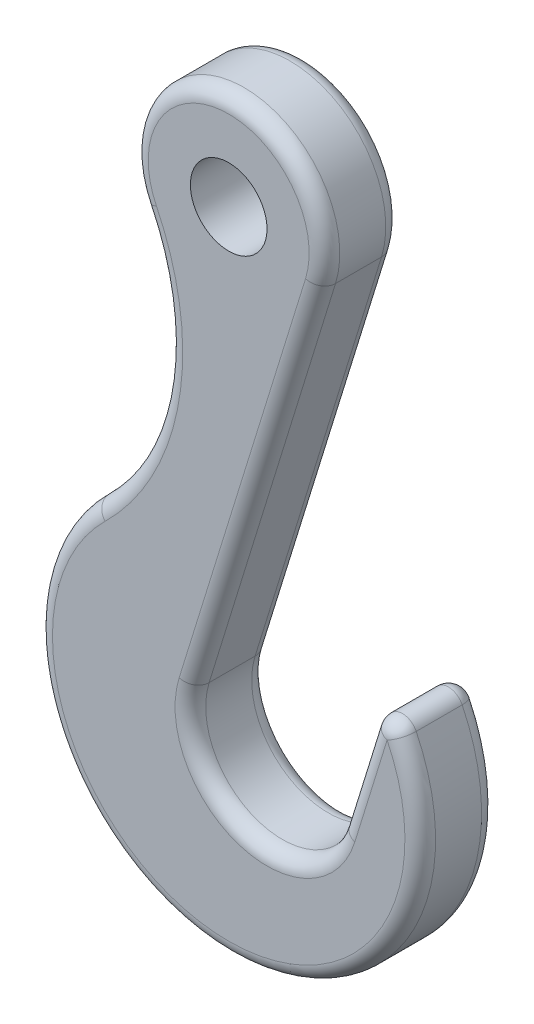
from build123d import *

# Parameters (mm, degrees)
EXTRUDE_1_DEPTH     = 10
SKETCH_4_R          = 5
CUT_EXTRUDE_1_DEPTH = 78.338541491
FILLET_1_R          = 2
FILLET_2_R          = 2


with BuildPart() as part:
    # Sketch 3 → Extrude 1 (new body)
    with BuildSketch(Plane.XY):
        with BuildLine():
            Line((11.942228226, 56.307685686), (-4.553782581, 2.953851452))
            ThreePointArc((-4.553782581, 2.953851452), (2.046148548, -9.553782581), (14.553782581, -2.953851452))
            Line((14.553782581, -2.953851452), (20.074081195, 14.900713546))
            ThreePointArc((20.074081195, 14.900713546), (-1.943226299, -24.924363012), (-17.522085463, 17.831896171))
            ThreePointArc((-17.522085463, 17.831896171), (-8.458087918, 35.15728691), (-11.231222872, 54.512775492))
            ThreePointArc((-11.231222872, 54.512775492), (-0.965301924, 72.462671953), (11.942228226, 56.307685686))
        make_face()
    extrude(amount=EXTRUDE_1_DEPTH)

    # Sketch 4 → Cut-Extrude 1 (cut, through all)
    with BuildSketch(Plane.XY):
        with Locations((0, 60)):
            Circle(SKETCH_4_R)
    extrude(amount=CUT_EXTRUDE_1_DEPTH, mode=Mode.SUBTRACT)

    # Fillet 1
    fillet_1_edges = [part.edges().sort_by_distance(p)[0] for p in [
        (20.074081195, 14.900713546, 5),
    ]]
    fillet(fillet_1_edges, radius=FILLET_1_R)

    # Fillet 2
    fillet_2_edges = [part.edges().sort_by_distance(p)[0] for p in [
        (-4.238326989, -24.638112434, 10),
        (2.046148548, -9.553782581, 10),
        (3.694222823, 29.630768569, 10),
        (16.65933937, 3.856251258, 0),
        (16.65933937, 3.856251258, 10),
        (20.522212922, 12.069689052, 0),
        (20.522212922, 12.069689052, 10),
        (-0.965301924, 72.462671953, 10),
        (3.694222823, 29.630768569, 0),
        (2.046148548, -9.553782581, 0),
        (-4.238326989, -24.638112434, 0),
        (-8.458087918, 35.15728691, 10),
        (-8.458087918, 35.15728691, 0),
        (-0.965301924, 72.462671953, 0),
    ]]
    fillet(fillet_2_edges, radius=FILLET_2_R)


solid = part.part
